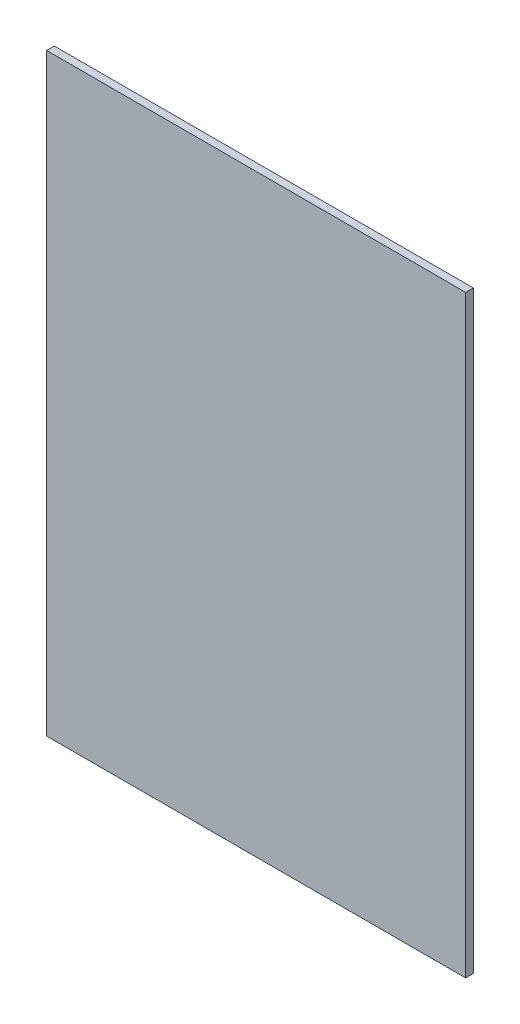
from build123d import *

# Parameters (mm, degrees)
SKETCH1_W           = 152.4
SKETCH1_H           = 215.9
BOSS_EXTRUDE1_DEPTH = 2.794


with BuildPart() as part:
    # Sketch1 → Boss-Extrude1 (new body)
    with BuildSketch(Plane.XY):
        Rectangle(SKETCH1_W, SKETCH1_H)
    extrude(amount=BOSS_EXTRUDE1_DEPTH)


solid = part.part
